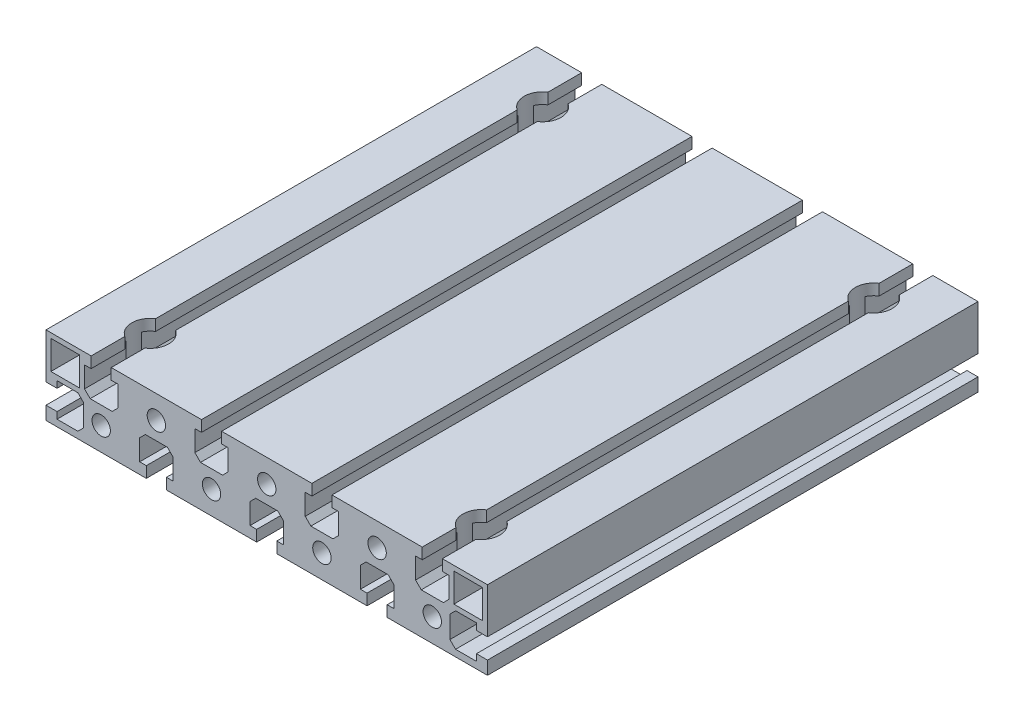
from build123d import *

# Parameters (mm, degrees)
EXTRUDE1_DEPTH             = 100
EXTRUDE1_DEPTH_BACK        = 100
SKETCH1_R                  = 3.75
SKETCH1_W                  = 11.699951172
SKETCH1_H                  = 11.700012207
F_15_0_15_DIAMETER_HOLE1_D = 15


with BuildPart() as part:
    # Sketch1 → Extrude1 (new, two sides: drawn at the far end of the back side and taken through both)
    with BuildSketch(Plane.XY.offset(-EXTRUDE1_DEPTH_BACK)):
        Polygon((-74.3, 18), (-71.6, 18), (-71.6, 22.5), (-90, 22.5), (-90, 4.1), (-85.5, 4.1), (-85.5, 6.8), (-77, 6.8), (-74.7, 4.5), (-74.7, -4.5), (-77, -6.8), (-85.5, -6.8), (-85.5, -4.1), (-90, -4.1), (-90, -9.5), (-49.1, -9.5), (-49.1, -5), (-51.8, -5), (-51.8, 3.5), (-49.5, 5.8), (-40.5, 5.8), (-38.2, 3.5), (-38.2, -5), (-40.9, -5), (-40.9, -9.5), (-4.1, -9.5), (-4.1, -5), (-6.8, -5), (-6.8, 3.5), (-4.5, 5.8), (4.5, 5.8), (6.8, 3.5), (6.8, -5), (4.1, -5), (4.1, -9.5), (40.9, -9.5), (40.9, -5), (38.2, -5), (38.2, 3.5), (40.5, 5.8), (49.5, 5.8), (51.8, 3.5), (51.8, -5), (49.1, -5), (49.1, -9.5), (90, -9.5), (90, -4.1), (85.5, -4.1), (85.5, -6.8), (77, -6.8), (74.7, -4.5), (74.7, 4.5), (77, 6.8), (85.5, 6.8), (85.5, 4.1), (90, 4.1), (90, 22.5), (71.6, 22.5), (71.6, 18), (74.3, 18), (74.3, 9.5), (72, 7.2), (63, 7.2), (60.7, 9.5), (60.7, 18), (63.4, 18), (63.4, 22.5), (26.6, 22.5), (26.6, 18), (29.3, 18), (29.3, 9.5), (27, 7.2), (18, 7.2), (15.7, 9.5), (15.7, 18), (18.4, 18), (18.4, 22.5), (-18.4, 22.5), (-18.4, 18), (-15.7, 18), (-15.7, 9.5), (-18, 7.2), (-27, 7.2), (-29.3, 9.5), (-29.3, 18), (-26.6, 18), (-26.6, 22.5), (-63.4, 22.5), (-63.4, 18), (-60.7, 18), (-60.7, 9.5), (-63, 7.2), (-72, 7.2), (-74.3, 9.5), align=None)
        with Locations((67.5, 0)):
            Circle(SKETCH1_R, mode=Mode.SUBTRACT)
        with Locations((45, 13)):
            Circle(SKETCH1_R, mode=Mode.SUBTRACT)
        with Locations((22.5, 0)):
            Circle(SKETCH1_R, mode=Mode.SUBTRACT)
        with Locations((0, 13)):
            Circle(SKETCH1_R, mode=Mode.SUBTRACT)
        with Locations((-22.5, 0)):
            Circle(SKETCH1_R, mode=Mode.SUBTRACT)
        with Locations((-45, 13)):
            Circle(SKETCH1_R, mode=Mode.SUBTRACT)
        with Locations((-67.5, 0)):
            Circle(SKETCH1_R, mode=Mode.SUBTRACT)
        with Locations((82.149975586, 14.649993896)):
            Rectangle(SKETCH1_W, SKETCH1_H, mode=Mode.SUBTRACT)
        with Locations((-82.150024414, 14.649993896)):
            Rectangle(SKETCH1_W, SKETCH1_H, mode=Mode.SUBTRACT)
    extrude(amount=EXTRUDE1_DEPTH + EXTRUDE1_DEPTH_BACK)

    # 15.0 _15_ Diameter Hole1 (through all)
    with Locations(Plane(origin=(-67.5, -9.5, 80), x_dir=(0, 0, -1), z_dir=(0, -1, 0))):
        with Locations((0, 0), (0, 135), (160, 0), (160, 135)):
            Hole(F_15_0_15_DIAMETER_HOLE1_D / 2)


solid = part.part
